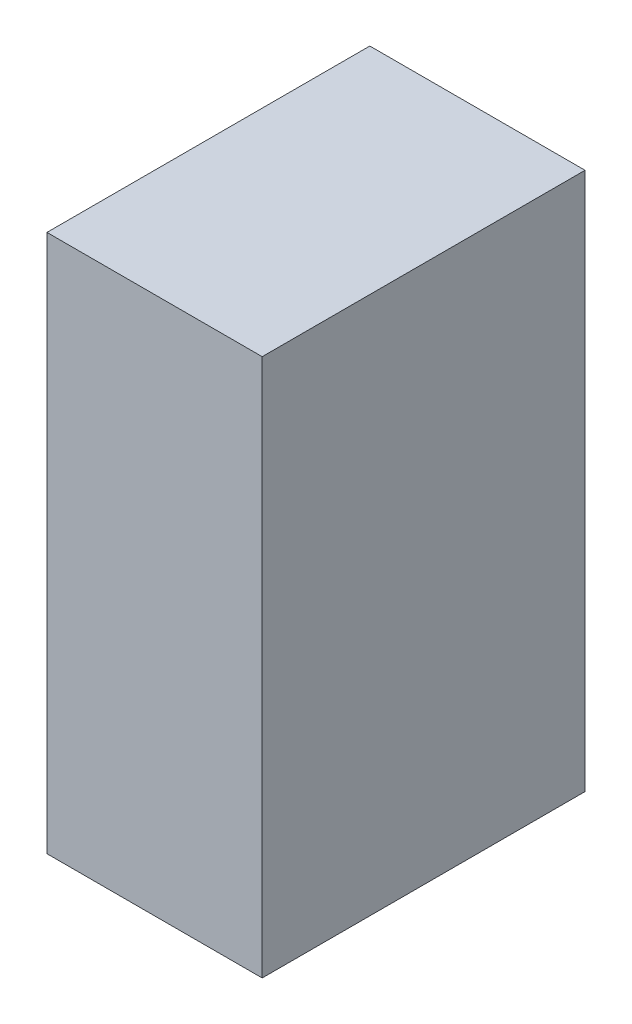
from build123d import *

# Parameters (mm, degrees)
SKIZZE1_W                       = 20
SKIZZE1_H                       = 50
AUFSATZ_LINEAR_AUSTRAGEN1_DEPTH = 30


with BuildPart() as part:
    # Skizze1 → Aufsatz-Linear austragen1 (new body)
    with BuildSketch(Plane.XY):
        with Locations((10, 25)):
            Rectangle(SKIZZE1_W, SKIZZE1_H)
    extrude(amount=-AUFSATZ_LINEAR_AUSTRAGEN1_DEPTH)


solid = part.part
